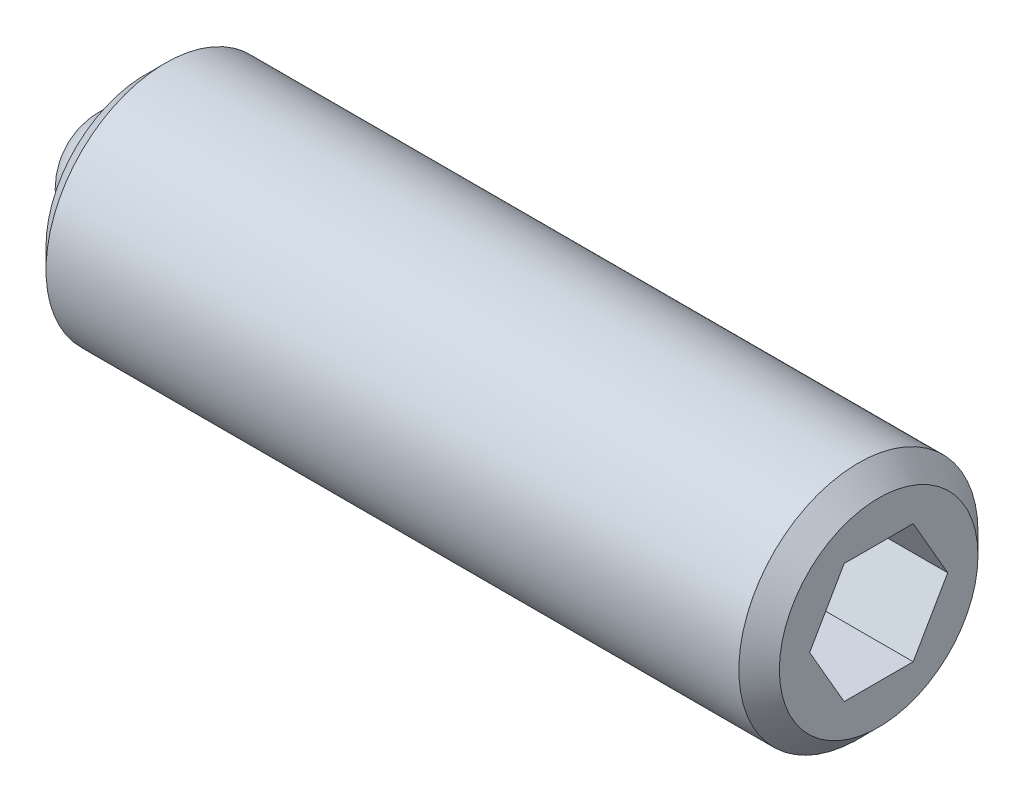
ISO-10303-21;
HEADER;
FILE_DESCRIPTION(('STEP AP214'),'2;1');
FILE_NAME('part.step','',(''),(''),'','','');
FILE_SCHEMA(('AUTOMOTIVE_DESIGN { 1 0 10303 214 1 1 1 1 }'));
ENDSEC;
DATA;
#1=APPLICATION_CONTEXT('core data for automotive mechanical design processes');
#2=APPLICATION_PROTOCOL_DEFINITION('international standard','automotive_design',2000,#1);
#3=PRODUCT_CONTEXT('',#1,'mechanical');
#4=PRODUCT('Part','Part','',(#3));
#5=PRODUCT_RELATED_PRODUCT_CATEGORY('part','',(#4));
#6=PRODUCT_DEFINITION_FORMATION('','',#4);
#7=PRODUCT_DEFINITION_CONTEXT('part definition',#1,'design');
#8=PRODUCT_DEFINITION('design','',#6,#7);
#9=PRODUCT_DEFINITION_SHAPE('','',#8);
#10=(LENGTH_UNIT() NAMED_UNIT(*) SI_UNIT(.MILLI.,.METRE.));
#11=(NAMED_UNIT(*) PLANE_ANGLE_UNIT() SI_UNIT($,.RADIAN.));
#12=(NAMED_UNIT(*) SI_UNIT($,.STERADIAN.) SOLID_ANGLE_UNIT());
#13=UNCERTAINTY_MEASURE_WITH_UNIT(LENGTH_MEASURE(1.E-05),#10,'distance_accuracy_value','');
#14=(GEOMETRIC_REPRESENTATION_CONTEXT(3) GLOBAL_UNCERTAINTY_ASSIGNED_CONTEXT((#13)) GLOBAL_UNIT_ASSIGNED_CONTEXT((#10,
#11,#12)) REPRESENTATION_CONTEXT('',''));
#15=CARTESIAN_POINT('',(0.,0.,0.));
#16=DIRECTION('',(0.,0.,1.));
#17=DIRECTION('',(1.,0.,0.));
#18=AXIS2_PLACEMENT_3D('',#15,#16,#17);
#19=CARTESIAN_POINT('',(0.,0.,0.));
#20=DIRECTION('',(0.,-1.,0.));
#21=DIRECTION('',(0.,0.,-1.));
#22=AXIS2_PLACEMENT_3D('',#19,#20,#21);
#23=SPHERICAL_SURFACE('',#22,0.8);
#24=CARTESIAN_POINT('',(0.,-0.8,0.));
#25=VERTEX_POINT('',#24);
#26=VERTEX_LOOP('',#25);
#27=FACE_BOUND('',#26,.T.);
#28=ADVANCED_FACE('F41',(#27),#23,.T.);
#29=CLOSED_SHELL('',(#28));
#30=MANIFOLD_SOLID_BREP('B2',#29);
#31=CARTESIAN_POINT('',(9.2,0.,0.));
#32=DIRECTION('',(-1.,0.,0.));
#33=DIRECTION('',(0.,0.,1.));
#34=AXIS2_PLACEMENT_3D('',#31,#32,#33);
#35=CYLINDRICAL_SURFACE('',#34,1.5);
#36=CARTESIAN_POINT('',(8.946,0.,0.));
#37=DIRECTION('',(1.,0.,0.));
#38=DIRECTION('',(0.,0.,-1.));
#39=AXIS2_PLACEMENT_3D('',#36,#37,#38);
#40=CIRCLE('',#39,1.5);
#41=CARTESIAN_POINT('',(8.946,0.,-1.5));
#42=VERTEX_POINT('',#41);
#43=EDGE_CURVE('E39',#42,#42,#40,.F.);
#44=ORIENTED_EDGE('',*,*,#43,.T.);
#45=EDGE_LOOP('',(#44));
#46=FACE_BOUND('',#45,.T.);
#47=CARTESIAN_POINT('',(0.253999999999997,0.,0.));
#48=DIRECTION('',(1.,0.,0.));
#49=DIRECTION('',(0.,0.,-1.));
#50=AXIS2_PLACEMENT_3D('',#47,#48,#49);
#51=CIRCLE('',#50,1.5);
#52=CARTESIAN_POINT('',(0.253999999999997,0.,-1.5));
#53=VERTEX_POINT('',#52);
#54=EDGE_CURVE('E157',#53,#53,#51,.T.);
#55=ORIENTED_EDGE('',*,*,#54,.T.);
#56=EDGE_LOOP('',(#55));
#57=FACE_BOUND('',#56,.T.);
#58=ADVANCED_FACE('F54',(#46,#57),#35,.T.);
#59=CARTESIAN_POINT('',(9.2,0.,0.));
#60=DIRECTION('',(1.,0.,0.));
#61=DIRECTION('',(0.,0.,-1.));
#62=AXIS2_PLACEMENT_3D('',#59,#60,#61);
#63=PLANE('',#62);
#64=DIRECTION('',(0.,0.866025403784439,-0.5));
#65=VECTOR('',#64,1.);
#66=CARTESIAN_POINT('',(9.2,-0.75,-0.43301270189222));
#67=LINE('',#66,#65);
#68=CARTESIAN_POINT('',(9.2,-0.75,-0.43301270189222));
#69=VERTEX_POINT('',#68);
#70=CARTESIAN_POINT('',(9.2,0.,-0.866025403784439));
#71=VERTEX_POINT('',#70);
#72=EDGE_CURVE('E69',#69,#71,#67,.T.);
#73=ORIENTED_EDGE('',*,*,#72,.F.);
#74=DIRECTION('',(0.,0.,-1.));
#75=VECTOR('',#74,1.);
#76=CARTESIAN_POINT('',(9.2,-0.75,0.433012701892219));
#77=LINE('',#76,#75);
#78=CARTESIAN_POINT('',(9.2,-0.75,0.433012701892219));
#79=VERTEX_POINT('',#78);
#80=EDGE_CURVE('E153',#79,#69,#77,.T.);
#81=ORIENTED_EDGE('',*,*,#80,.F.);
#82=DIRECTION('',(0.,-0.866025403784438,-0.5));
#83=VECTOR('',#82,1.);
#84=CARTESIAN_POINT('',(9.2,0.,0.866025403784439));
#85=LINE('',#84,#83);
#86=CARTESIAN_POINT('',(9.2,0.,0.866025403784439));
#87=VERTEX_POINT('',#86);
#88=EDGE_CURVE('E151',#87,#79,#85,.T.);
#89=ORIENTED_EDGE('',*,*,#88,.F.);
#90=DIRECTION('',(0.,-0.866025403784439,0.5));
#91=VECTOR('',#90,1.);
#92=CARTESIAN_POINT('',(9.2,0.75,0.433012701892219));
#93=LINE('',#92,#91);
#94=CARTESIAN_POINT('',(9.2,0.75,0.433012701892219));
#95=VERTEX_POINT('',#94);
#96=EDGE_CURVE('E117',#95,#87,#93,.T.);
#97=ORIENTED_EDGE('',*,*,#96,.F.);
#98=DIRECTION('',(0.,0.,1.));
#99=VECTOR('',#98,1.);
#100=CARTESIAN_POINT('',(9.2,0.75,-0.433012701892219));
#101=LINE('',#100,#99);
#102=CARTESIAN_POINT('',(9.2,0.75,-0.433012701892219));
#103=VERTEX_POINT('',#102);
#104=EDGE_CURVE('E147',#103,#95,#101,.T.);
#105=ORIENTED_EDGE('',*,*,#104,.F.);
#106=DIRECTION('',(0.,0.866025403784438,0.5));
#107=VECTOR('',#106,1.);
#108=CARTESIAN_POINT('',(9.2,0.,-0.866025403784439));
#109=LINE('',#108,#107);
#110=EDGE_CURVE('E143',#71,#103,#109,.T.);
#111=ORIENTED_EDGE('',*,*,#110,.F.);
#112=EDGE_LOOP('',(#73,#81,#89,#97,#105,#111));
#113=FACE_BOUND('',#112,.T.);
#114=CARTESIAN_POINT('',(9.2,0.,0.));
#115=DIRECTION('',(1.,0.,0.));
#116=DIRECTION('',(0.,0.,-1.));
#117=AXIS2_PLACEMENT_3D('',#114,#115,#116);
#118=CIRCLE('',#117,1.246);
#119=CARTESIAN_POINT('',(9.2,0.,-1.246));
#120=VERTEX_POINT('',#119);
#121=EDGE_CURVE('E62',#120,#120,#118,.T.);
#122=ORIENTED_EDGE('',*,*,#121,.T.);
#123=EDGE_LOOP('',(#122));
#124=FACE_BOUND('',#123,.T.);
#125=ADVANCED_FACE('F170',(#113,#124),#63,.T.);
#126=CARTESIAN_POINT('',(0.,0.,0.));
#127=DIRECTION('',(1.,0.,0.));
#128=DIRECTION('',(0.,0.,-1.));
#129=AXIS2_PLACEMENT_3D('',#126,#127,#128);
#130=PLANE('',#129);
#131=CARTESIAN_POINT('',(0.,0.,0.));
#132=DIRECTION('',(-1.,0.,0.));
#133=DIRECTION('',(0.,0.,1.));
#134=AXIS2_PLACEMENT_3D('',#131,#132,#133);
#135=CIRCLE('',#134,0.8);
#136=CARTESIAN_POINT('',(0.,0.,0.8));
#137=VERTEX_POINT('',#136);
#138=EDGE_CURVE('E225',#137,#137,#135,.T.);
#139=ORIENTED_EDGE('',*,*,#138,.F.);
#140=EDGE_LOOP('',(#139));
#141=FACE_BOUND('',#140,.T.);
#142=CARTESIAN_POINT('',(0.,0.,0.));
#143=DIRECTION('',(1.,0.,0.));
#144=DIRECTION('',(0.,0.,-1.));
#145=AXIS2_PLACEMENT_3D('',#142,#143,#144);
#146=CIRCLE('',#145,1.246);
#147=CARTESIAN_POINT('',(0.,0.,-1.246));
#148=VERTEX_POINT('',#147);
#149=EDGE_CURVE('E165',#148,#148,#146,.F.);
#150=ORIENTED_EDGE('',*,*,#149,.T.);
#151=EDGE_LOOP('',(#150));
#152=FACE_BOUND('',#151,.T.);
#153=ADVANCED_FACE('F182',(#141,#152),#130,.F.);
#154=CARTESIAN_POINT('',(0.253999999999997,0.,0.));
#155=DIRECTION('',(1.,0.,0.));
#156=DIRECTION('',(0.,0.,-1.));
#157=AXIS2_PLACEMENT_3D('',#154,#155,#156);
#158=CONICAL_SURFACE('',#157,1.5,0.785398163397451);
#159=ORIENTED_EDGE('',*,*,#149,.F.);
#160=EDGE_LOOP('',(#159));
#161=FACE_BOUND('',#160,.T.);
#162=ORIENTED_EDGE('',*,*,#54,.F.);
#163=EDGE_LOOP('',(#162));
#164=FACE_BOUND('',#163,.T.);
#165=ADVANCED_FACE('F174',(#161,#164),#158,.T.);
#166=CARTESIAN_POINT('',(9.2,0.,0.));
#167=DIRECTION('',(-1.,0.,0.));
#168=DIRECTION('',(0.,0.,1.));
#169=AXIS2_PLACEMENT_3D('',#166,#167,#168);
#170=CONICAL_SURFACE('',#169,1.246,0.785398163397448);
#171=ORIENTED_EDGE('',*,*,#43,.F.);
#172=EDGE_LOOP('',(#171));
#173=FACE_BOUND('',#172,.T.);
#174=ORIENTED_EDGE('',*,*,#121,.F.);
#175=EDGE_LOOP('',(#174));
#176=FACE_BOUND('',#175,.T.);
#177=ADVANCED_FACE('F56',(#173,#176),#170,.T.);
#178=CARTESIAN_POINT('',(7.2,-0.75,-0.43301270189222));
#179=DIRECTION('',(0.,-0.5,-0.866025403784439));
#180=DIRECTION('',(0.,0.866025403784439,-0.5));
#181=AXIS2_PLACEMENT_3D('',#178,#179,#180);
#182=PLANE('',#181);
#183=ORIENTED_EDGE('',*,*,#72,.T.);
#184=DIRECTION('',(1.,0.,0.));
#185=VECTOR('',#184,1.);
#186=CARTESIAN_POINT('',(7.2,0.,-0.866025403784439));
#187=LINE('',#186,#185);
#188=CARTESIAN_POINT('',(7.2,0.,-0.866025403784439));
#189=VERTEX_POINT('',#188);
#190=EDGE_CURVE('E99',#189,#71,#187,.T.);
#191=ORIENTED_EDGE('',*,*,#190,.F.);
#192=DIRECTION('',(0.,0.866025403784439,-0.5));
#193=VECTOR('',#192,1.);
#194=CARTESIAN_POINT('',(7.2,-0.75,-0.43301270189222));
#195=LINE('',#194,#193);
#196=CARTESIAN_POINT('',(7.2,-0.75,-0.43301270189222));
#197=VERTEX_POINT('',#196);
#198=EDGE_CURVE('E155',#197,#189,#195,.T.);
#199=ORIENTED_EDGE('',*,*,#198,.F.);
#200=DIRECTION('',(1.,0.,0.));
#201=VECTOR('',#200,1.);
#202=CARTESIAN_POINT('',(7.2,-0.75,-0.43301270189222));
#203=LINE('',#202,#201);
#204=EDGE_CURVE('E77',#197,#69,#203,.T.);
#205=ORIENTED_EDGE('',*,*,#204,.T.);
#206=EDGE_LOOP('',(#183,#191,#199,#205));
#207=FACE_BOUND('',#206,.T.);
#208=ADVANCED_FACE('F173',(#207),#182,.F.);
#209=CARTESIAN_POINT('',(7.2,-0.75,0.433012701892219));
#210=DIRECTION('',(0.,-1.,0.));
#211=DIRECTION('',(0.,0.,-1.));
#212=AXIS2_PLACEMENT_3D('',#209,#210,#211);
#213=PLANE('',#212);
#214=ORIENTED_EDGE('',*,*,#80,.T.);
#215=ORIENTED_EDGE('',*,*,#204,.F.);
#216=DIRECTION('',(0.,0.,-1.));
#217=VECTOR('',#216,1.);
#218=CARTESIAN_POINT('',(7.2,-0.75,0.433012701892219));
#219=LINE('',#218,#217);
#220=CARTESIAN_POINT('',(7.2,-0.75,0.433012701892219));
#221=VERTEX_POINT('',#220);
#222=EDGE_CURVE('E129',#221,#197,#219,.T.);
#223=ORIENTED_EDGE('',*,*,#222,.F.);
#224=DIRECTION('',(1.,0.,0.));
#225=VECTOR('',#224,1.);
#226=CARTESIAN_POINT('',(7.2,-0.75,0.433012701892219));
#227=LINE('',#226,#225);
#228=EDGE_CURVE('E121',#221,#79,#227,.T.);
#229=ORIENTED_EDGE('',*,*,#228,.T.);
#230=EDGE_LOOP('',(#214,#215,#223,#229));
#231=FACE_BOUND('',#230,.T.);
#232=ADVANCED_FACE('F180',(#231),#213,.F.);
#233=CARTESIAN_POINT('',(7.2,0.,0.866025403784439));
#234=DIRECTION('',(0.,-0.5,0.866025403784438));
#235=DIRECTION('',(0.,-0.866025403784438,-0.5));
#236=AXIS2_PLACEMENT_3D('',#233,#234,#235);
#237=PLANE('',#236);
#238=ORIENTED_EDGE('',*,*,#88,.T.);
#239=ORIENTED_EDGE('',*,*,#228,.F.);
#240=DIRECTION('',(0.,-0.866025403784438,-0.5));
#241=VECTOR('',#240,1.);
#242=CARTESIAN_POINT('',(7.2,0.,0.866025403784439));
#243=LINE('',#242,#241);
#244=CARTESIAN_POINT('',(7.2,0.,0.866025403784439));
#245=VERTEX_POINT('',#244);
#246=EDGE_CURVE('E125',#245,#221,#243,.T.);
#247=ORIENTED_EDGE('',*,*,#246,.F.);
#248=DIRECTION('',(1.,0.,0.));
#249=VECTOR('',#248,1.);
#250=CARTESIAN_POINT('',(7.2,0.,0.866025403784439));
#251=LINE('',#250,#249);
#252=EDGE_CURVE('E110',#245,#87,#251,.T.);
#253=ORIENTED_EDGE('',*,*,#252,.T.);
#254=EDGE_LOOP('',(#238,#239,#247,#253));
#255=FACE_BOUND('',#254,.T.);
#256=ADVANCED_FACE('F126',(#255),#237,.F.);
#257=CARTESIAN_POINT('',(7.2,0.75,0.433012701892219));
#258=DIRECTION('',(0.,0.5,0.866025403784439));
#259=DIRECTION('',(0.,-0.866025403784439,0.5));
#260=AXIS2_PLACEMENT_3D('',#257,#258,#259);
#261=PLANE('',#260);
#262=ORIENTED_EDGE('',*,*,#96,.T.);
#263=ORIENTED_EDGE('',*,*,#252,.F.);
#264=DIRECTION('',(0.,-0.866025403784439,0.5));
#265=VECTOR('',#264,1.);
#266=CARTESIAN_POINT('',(7.2,0.75,0.433012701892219));
#267=LINE('',#266,#265);
#268=CARTESIAN_POINT('',(7.2,0.75,0.433012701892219));
#269=VERTEX_POINT('',#268);
#270=EDGE_CURVE('E114',#269,#245,#267,.T.);
#271=ORIENTED_EDGE('',*,*,#270,.F.);
#272=DIRECTION('',(1.,0.,0.));
#273=VECTOR('',#272,1.);
#274=CARTESIAN_POINT('',(7.2,0.75,0.433012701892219));
#275=LINE('',#274,#273);
#276=EDGE_CURVE('E122',#269,#95,#275,.T.);
#277=ORIENTED_EDGE('',*,*,#276,.T.);
#278=EDGE_LOOP('',(#262,#263,#271,#277));
#279=FACE_BOUND('',#278,.T.);
#280=ADVANCED_FACE('F112',(#279),#261,.F.);
#281=CARTESIAN_POINT('',(7.2,0.75,-0.433012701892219));
#282=DIRECTION('',(0.,1.,0.));
#283=DIRECTION('',(0.,0.,1.));
#284=AXIS2_PLACEMENT_3D('',#281,#282,#283);
#285=PLANE('',#284);
#286=ORIENTED_EDGE('',*,*,#104,.T.);
#287=ORIENTED_EDGE('',*,*,#276,.F.);
#288=DIRECTION('',(0.,0.,1.));
#289=VECTOR('',#288,1.);
#290=CARTESIAN_POINT('',(7.2,0.75,-0.433012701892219));
#291=LINE('',#290,#289);
#292=CARTESIAN_POINT('',(7.2,0.75,-0.433012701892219));
#293=VERTEX_POINT('',#292);
#294=EDGE_CURVE('E135',#293,#269,#291,.T.);
#295=ORIENTED_EDGE('',*,*,#294,.F.);
#296=DIRECTION('',(1.,0.,0.));
#297=VECTOR('',#296,1.);
#298=CARTESIAN_POINT('',(7.2,0.75,-0.433012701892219));
#299=LINE('',#298,#297);
#300=EDGE_CURVE('E160',#293,#103,#299,.T.);
#301=ORIENTED_EDGE('',*,*,#300,.T.);
#302=EDGE_LOOP('',(#286,#287,#295,#301));
#303=FACE_BOUND('',#302,.T.);
#304=ADVANCED_FACE('F201',(#303),#285,.F.);
#305=CARTESIAN_POINT('',(7.2,0.,-0.866025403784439));
#306=DIRECTION('',(0.,0.500000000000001,-0.866025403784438));
#307=DIRECTION('',(0.,0.866025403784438,0.500000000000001));
#308=AXIS2_PLACEMENT_3D('',#305,#306,#307);
#309=PLANE('',#308);
#310=ORIENTED_EDGE('',*,*,#110,.T.);
#311=ORIENTED_EDGE('',*,*,#300,.F.);
#312=DIRECTION('',(0.,0.866025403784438,0.5));
#313=VECTOR('',#312,1.);
#314=CARTESIAN_POINT('',(7.2,0.,-0.866025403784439));
#315=LINE('',#314,#313);
#316=EDGE_CURVE('E137',#189,#293,#315,.T.);
#317=ORIENTED_EDGE('',*,*,#316,.F.);
#318=ORIENTED_EDGE('',*,*,#190,.T.);
#319=EDGE_LOOP('',(#310,#311,#317,#318));
#320=FACE_BOUND('',#319,.T.);
#321=ADVANCED_FACE('F198',(#320),#309,.F.);
#322=CARTESIAN_POINT('',(7.2,0.,0.));
#323=DIRECTION('',(1.,0.,0.));
#324=DIRECTION('',(0.,0.,-1.));
#325=AXIS2_PLACEMENT_3D('',#322,#323,#324);
#326=PLANE('',#325);
#327=ORIENTED_EDGE('',*,*,#198,.T.);
#328=ORIENTED_EDGE('',*,*,#316,.T.);
#329=ORIENTED_EDGE('',*,*,#294,.T.);
#330=ORIENTED_EDGE('',*,*,#270,.T.);
#331=ORIENTED_EDGE('',*,*,#246,.T.);
#332=ORIENTED_EDGE('',*,*,#222,.T.);
#333=EDGE_LOOP('',(#327,#328,#329,#330,#331,#332));
#334=FACE_BOUND('',#333,.T.);
#335=ADVANCED_FACE('F132',(#334),#326,.T.);
#336=CARTESIAN_POINT('',(0.8,0.,0.));
#337=DIRECTION('',(-1.,0.,0.));
#338=DIRECTION('',(0.,0.,1.));
#339=AXIS2_PLACEMENT_3D('',#336,#337,#338);
#340=CYLINDRICAL_SURFACE('',#339,0.8);
#341=CARTESIAN_POINT('',(0.8,0.,0.));
#342=DIRECTION('',(-1.,0.,0.));
#343=DIRECTION('',(0.,0.,1.));
#344=AXIS2_PLACEMENT_3D('',#341,#342,#343);
#345=CIRCLE('',#344,0.8);
#346=CARTESIAN_POINT('',(0.8,0.,0.8));
#347=VERTEX_POINT('',#346);
#348=EDGE_CURVE('E144',#347,#347,#345,.T.);
#349=ORIENTED_EDGE('',*,*,#348,.F.);
#350=EDGE_LOOP('',(#349));
#351=FACE_BOUND('',#350,.T.);
#352=ORIENTED_EDGE('',*,*,#138,.T.);
#353=EDGE_LOOP('',(#352));
#354=FACE_BOUND('',#353,.T.);
#355=ADVANCED_FACE('F214',(#351,#354),#340,.F.);
#356=CARTESIAN_POINT('',(0.8,0.,0.));
#357=DIRECTION('',(-1.,0.,0.));
#358=DIRECTION('',(0.,0.,1.));
#359=AXIS2_PLACEMENT_3D('',#356,#357,#358);
#360=PLANE('',#359);
#361=ORIENTED_EDGE('',*,*,#348,.T.);
#362=EDGE_LOOP('',(#361));
#363=FACE_BOUND('',#362,.T.);
#364=ADVANCED_FACE('F217',(#363),#360,.T.);
#365=CLOSED_SHELL('',(#58,#125,#153,#165,#177,#208,#232,#256,#280,#304,#321,#335,#355,#364));
#366=MANIFOLD_SOLID_BREP('B6',#365);
#367=ADVANCED_BREP_SHAPE_REPRESENTATION('',(#18,#30,#366),#14);
#368=SHAPE_DEFINITION_REPRESENTATION(#9,#367);
ENDSEC;
END-ISO-10303-21;
